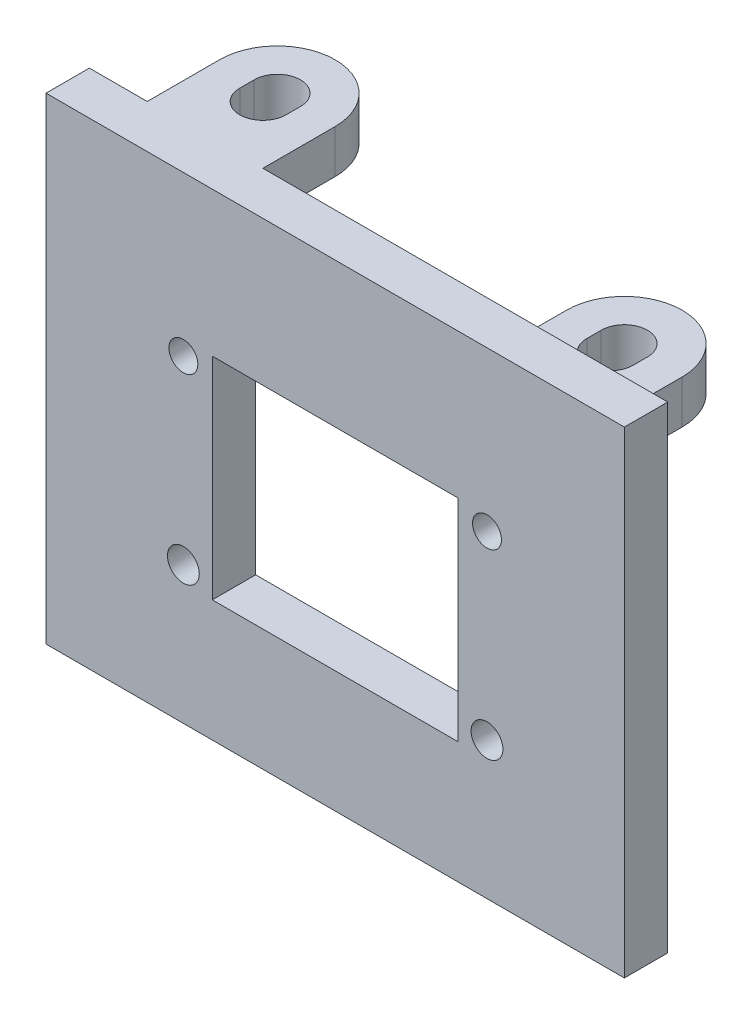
ISO-10303-21;
HEADER;
FILE_DESCRIPTION(('STEP AP214'),'2;1');
FILE_NAME('part.step','',(''),(''),'','','');
FILE_SCHEMA(('AUTOMOTIVE_DESIGN { 1 0 10303 214 1 1 1 1 }'));
ENDSEC;
DATA;
#1=APPLICATION_CONTEXT('core data for automotive mechanical design processes');
#2=APPLICATION_PROTOCOL_DEFINITION('international standard','automotive_design',2000,#1);
#3=PRODUCT_CONTEXT('',#1,'mechanical');
#4=PRODUCT('Part','Part','',(#3));
#5=PRODUCT_RELATED_PRODUCT_CATEGORY('part','',(#4));
#6=PRODUCT_DEFINITION_FORMATION('','',#4);
#7=PRODUCT_DEFINITION_CONTEXT('part definition',#1,'design');
#8=PRODUCT_DEFINITION('design','',#6,#7);
#9=PRODUCT_DEFINITION_SHAPE('','',#8);
#10=(LENGTH_UNIT() NAMED_UNIT(*) SI_UNIT(.MILLI.,.METRE.));
#11=(NAMED_UNIT(*) PLANE_ANGLE_UNIT() SI_UNIT($,.RADIAN.));
#12=(NAMED_UNIT(*) SI_UNIT($,.STERADIAN.) SOLID_ANGLE_UNIT());
#13=UNCERTAINTY_MEASURE_WITH_UNIT(LENGTH_MEASURE(1.E-05),#10,'distance_accuracy_value','');
#14=(GEOMETRIC_REPRESENTATION_CONTEXT(3) GLOBAL_UNCERTAINTY_ASSIGNED_CONTEXT((#13)) GLOBAL_UNIT_ASSIGNED_CONTEXT((#10,
#11,#12)) REPRESENTATION_CONTEXT('',''));
#15=CARTESIAN_POINT('',(0.,0.,0.));
#16=DIRECTION('',(0.,0.,1.));
#17=DIRECTION('',(1.,0.,0.));
#18=AXIS2_PLACEMENT_3D('',#15,#16,#17);
#19=CARTESIAN_POINT('',(0.,3.,3.));
#20=DIRECTION('',(0.,0.,1.));
#21=DIRECTION('',(1.,0.,0.));
#22=AXIS2_PLACEMENT_3D('',#19,#20,#21);
#23=PLANE('',#22);
#24=DIRECTION('',(-1.,0.,0.));
#25=VECTOR('',#24,1.);
#26=CARTESIAN_POINT('',(0.,3.,3.));
#27=LINE('',#26,#25);
#28=CARTESIAN_POINT('',(20.,3.,3.));
#29=VERTEX_POINT('',#28);
#30=CARTESIAN_POINT('',(-20.,3.,3.));
#31=VERTEX_POINT('',#30);
#32=EDGE_CURVE('E226',#29,#31,#27,.T.);
#33=ORIENTED_EDGE('',*,*,#32,.T.);
#34=DIRECTION('',(0.,-1.,0.));
#35=VECTOR('',#34,1.);
#36=CARTESIAN_POINT('',(-20.,0.,3.));
#37=LINE('',#36,#35);
#38=CARTESIAN_POINT('',(-20.,-30.,3.));
#39=VERTEX_POINT('',#38);
#40=EDGE_CURVE('E207',#31,#39,#37,.T.);
#41=ORIENTED_EDGE('',*,*,#40,.T.);
#42=DIRECTION('',(-1.,0.,0.));
#43=VECTOR('',#42,1.);
#44=CARTESIAN_POINT('',(0.,-30.,3.));
#45=LINE('',#44,#43);
#46=CARTESIAN_POINT('',(20.,-30.,2.99999999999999));
#47=VERTEX_POINT('',#46);
#48=EDGE_CURVE('E352',#47,#39,#45,.T.);
#49=ORIENTED_EDGE('',*,*,#48,.F.);
#50=DIRECTION('',(0.,-1.,0.));
#51=VECTOR('',#50,1.);
#52=CARTESIAN_POINT('',(20.,0.,3.));
#53=LINE('',#52,#51);
#54=EDGE_CURVE('E234',#29,#47,#53,.T.);
#55=ORIENTED_EDGE('',*,*,#54,.F.);
#56=EDGE_LOOP('',(#33,#41,#49,#55));
#57=FACE_BOUND('',#56,.T.);
#58=CARTESIAN_POINT('',(10.5,-8.,3.));
#59=DIRECTION('',(0.,0.,1.));
#60=DIRECTION('',(1.,0.,0.));
#61=AXIS2_PLACEMENT_3D('',#58,#59,#60);
#62=CIRCLE('',#61,1.);
#63=CARTESIAN_POINT('',(11.5,-8.,3.));
#64=VERTEX_POINT('',#63);
#65=EDGE_CURVE('E395',#64,#64,#62,.F.);
#66=ORIENTED_EDGE('',*,*,#65,.T.);
#67=EDGE_LOOP('',(#66));
#68=FACE_BOUND('',#67,.T.);
#69=CARTESIAN_POINT('',(-10.5,-20.5,3.));
#70=DIRECTION('',(0.,0.,1.));
#71=DIRECTION('',(1.,0.,0.));
#72=AXIS2_PLACEMENT_3D('',#69,#70,#71);
#73=CIRCLE('',#72,1.1);
#74=CARTESIAN_POINT('',(-9.4,-20.5,3.));
#75=VERTEX_POINT('',#74);
#76=EDGE_CURVE('E390',#75,#75,#73,.T.);
#77=ORIENTED_EDGE('',*,*,#76,.F.);
#78=EDGE_LOOP('',(#77));
#79=FACE_BOUND('',#78,.T.);
#80=CARTESIAN_POINT('',(-10.5,-8.,3.));
#81=DIRECTION('',(0.,0.,1.));
#82=DIRECTION('',(1.,0.,0.));
#83=AXIS2_PLACEMENT_3D('',#80,#81,#82);
#84=CIRCLE('',#83,1.);
#85=CARTESIAN_POINT('',(-9.5,-8.,3.));
#86=VERTEX_POINT('',#85);
#87=EDGE_CURVE('E394',#86,#86,#84,.T.);
#88=ORIENTED_EDGE('',*,*,#87,.F.);
#89=EDGE_LOOP('',(#88));
#90=FACE_BOUND('',#89,.T.);
#91=CARTESIAN_POINT('',(10.5,-20.5,3.));
#92=DIRECTION('',(0.,0.,1.));
#93=DIRECTION('',(1.,0.,0.));
#94=AXIS2_PLACEMENT_3D('',#91,#92,#93);
#95=CIRCLE('',#94,1.1);
#96=CARTESIAN_POINT('',(11.6,-20.5,3.));
#97=VERTEX_POINT('',#96);
#98=EDGE_CURVE('E381',#97,#97,#95,.F.);
#99=ORIENTED_EDGE('',*,*,#98,.T.);
#100=EDGE_LOOP('',(#99));
#101=FACE_BOUND('',#100,.T.);
#102=DIRECTION('',(1.,0.,0.));
#103=VECTOR('',#102,1.);
#104=CARTESIAN_POINT('',(0.,-21.6,3.));
#105=LINE('',#104,#103);
#106=CARTESIAN_POINT('',(-8.5,-21.6,3.));
#107=VERTEX_POINT('',#106);
#108=CARTESIAN_POINT('',(8.50000000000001,-21.6,3.));
#109=VERTEX_POINT('',#108);
#110=EDGE_CURVE('E62',#107,#109,#105,.T.);
#111=ORIENTED_EDGE('',*,*,#110,.F.);
#112=DIRECTION('',(0.,1.,0.));
#113=VECTOR('',#112,1.);
#114=CARTESIAN_POINT('',(-8.5,0.,3.));
#115=LINE('',#114,#113);
#116=CARTESIAN_POINT('',(-8.5,-7.,3.));
#117=VERTEX_POINT('',#116);
#118=EDGE_CURVE('E389',#107,#117,#115,.T.);
#119=ORIENTED_EDGE('',*,*,#118,.T.);
#120=DIRECTION('',(1.,0.,0.));
#121=VECTOR('',#120,1.);
#122=CARTESIAN_POINT('',(0.,-7.,3.));
#123=LINE('',#122,#121);
#124=CARTESIAN_POINT('',(8.5,-6.99999999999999,3.));
#125=VERTEX_POINT('',#124);
#126=EDGE_CURVE('E375',#117,#125,#123,.T.);
#127=ORIENTED_EDGE('',*,*,#126,.T.);
#128=DIRECTION('',(0.,1.,0.));
#129=VECTOR('',#128,1.);
#130=CARTESIAN_POINT('',(8.5,0.,3.));
#131=LINE('',#130,#129);
#132=EDGE_CURVE('E857',#109,#125,#131,.T.);
#133=ORIENTED_EDGE('',*,*,#132,.F.);
#134=EDGE_LOOP('',(#111,#119,#127,#133));
#135=FACE_BOUND('',#134,.T.);
#136=ADVANCED_FACE('F47',(#57,#68,#79,#90,#101,#135),#23,.T.);
#137=CARTESIAN_POINT('',(0.,3.,0.));
#138=DIRECTION('',(0.,0.,-1.));
#139=DIRECTION('',(-1.,0.,0.));
#140=AXIS2_PLACEMENT_3D('',#137,#138,#139);
#141=PLANE('',#140);
#142=DIRECTION('',(1.,0.,0.));
#143=VECTOR('',#142,1.);
#144=CARTESIAN_POINT('',(0.,-30.,0.));
#145=LINE('',#144,#143);
#146=CARTESIAN_POINT('',(-20.,-30.,0.));
#147=VERTEX_POINT('',#146);
#148=CARTESIAN_POINT('',(20.,-30.,0.));
#149=VERTEX_POINT('',#148);
#150=EDGE_CURVE('E412',#147,#149,#145,.T.);
#151=ORIENTED_EDGE('',*,*,#150,.F.);
#152=DIRECTION('',(0.,1.,0.));
#153=VECTOR('',#152,1.);
#154=CARTESIAN_POINT('',(-20.,3.,0.));
#155=LINE('',#154,#153);
#156=CARTESIAN_POINT('',(-20.,3.,0.));
#157=VERTEX_POINT('',#156);
#158=EDGE_CURVE('E340',#147,#157,#155,.T.);
#159=ORIENTED_EDGE('',*,*,#158,.T.);
#160=DIRECTION('',(1.,0.,0.));
#161=VECTOR('',#160,1.);
#162=CARTESIAN_POINT('',(0.,3.,0.));
#163=LINE('',#162,#161);
#164=CARTESIAN_POINT('',(-16.,3.,0.));
#165=VERTEX_POINT('',#164);
#166=EDGE_CURVE('E228',#157,#165,#163,.T.);
#167=ORIENTED_EDGE('',*,*,#166,.T.);
#168=DIRECTION('',(0.,-1.,0.));
#169=VECTOR('',#168,1.);
#170=CARTESIAN_POINT('',(-16.,3.,0.));
#171=LINE('',#170,#169);
#172=CARTESIAN_POINT('',(-16.,0.,0.));
#173=VERTEX_POINT('',#172);
#174=EDGE_CURVE('E273',#165,#173,#171,.T.);
#175=ORIENTED_EDGE('',*,*,#174,.T.);
#176=DIRECTION('',(1.,0.,0.));
#177=VECTOR('',#176,1.);
#178=CARTESIAN_POINT('',(0.,0.,0.));
#179=LINE('',#178,#177);
#180=CARTESIAN_POINT('',(-8.,0.,0.));
#181=VERTEX_POINT('',#180);
#182=EDGE_CURVE('E315',#173,#181,#179,.T.);
#183=ORIENTED_EDGE('',*,*,#182,.T.);
#184=DIRECTION('',(0.,-1.,0.));
#185=VECTOR('',#184,1.);
#186=CARTESIAN_POINT('',(-8.,3.,0.));
#187=LINE('',#186,#185);
#188=CARTESIAN_POINT('',(-8.,3.,0.));
#189=VERTEX_POINT('',#188);
#190=EDGE_CURVE('E305',#189,#181,#187,.T.);
#191=ORIENTED_EDGE('',*,*,#190,.F.);
#192=CARTESIAN_POINT('',(20.,3.,0.));
#193=VERTEX_POINT('',#192);
#194=EDGE_CURVE('E236',#189,#193,#163,.T.);
#195=ORIENTED_EDGE('',*,*,#194,.T.);
#196=DIRECTION('',(0.,1.,0.));
#197=VECTOR('',#196,1.);
#198=CARTESIAN_POINT('',(20.,3.,0.));
#199=LINE('',#198,#197);
#200=EDGE_CURVE('E230',#149,#193,#199,.T.);
#201=ORIENTED_EDGE('',*,*,#200,.F.);
#202=EDGE_LOOP('',(#151,#159,#167,#175,#183,#191,#195,#201));
#203=FACE_BOUND('',#202,.T.);
#204=CARTESIAN_POINT('',(10.5,-8.,0.));
#205=DIRECTION('',(0.,0.,-1.));
#206=DIRECTION('',(-1.,0.,0.));
#207=AXIS2_PLACEMENT_3D('',#204,#205,#206);
#208=CIRCLE('',#207,1.);
#209=CARTESIAN_POINT('',(9.5,-8.,0.));
#210=VERTEX_POINT('',#209);
#211=EDGE_CURVE('E335',#210,#210,#208,.F.);
#212=ORIENTED_EDGE('',*,*,#211,.T.);
#213=EDGE_LOOP('',(#212));
#214=FACE_BOUND('',#213,.T.);
#215=DIRECTION('',(1.,0.,0.));
#216=VECTOR('',#215,1.);
#217=CARTESIAN_POINT('',(0.,0.,0.));
#218=LINE('',#217,#216);
#219=CARTESIAN_POINT('',(8.,0.,0.));
#220=VERTEX_POINT('',#219);
#221=CARTESIAN_POINT('',(16.,0.,0.));
#222=VERTEX_POINT('',#221);
#223=EDGE_CURVE('E274',#220,#222,#218,.T.);
#224=ORIENTED_EDGE('',*,*,#223,.F.);
#225=DIRECTION('',(0.,1.,0.));
#226=VECTOR('',#225,1.);
#227=CARTESIAN_POINT('',(8.,-3.,0.));
#228=LINE('',#227,#226);
#229=CARTESIAN_POINT('',(8.,-3.,0.));
#230=VERTEX_POINT('',#229);
#231=EDGE_CURVE('E480',#230,#220,#228,.T.);
#232=ORIENTED_EDGE('',*,*,#231,.F.);
#233=DIRECTION('',(1.,0.,0.));
#234=VECTOR('',#233,1.);
#235=CARTESIAN_POINT('',(0.,-3.,0.));
#236=LINE('',#235,#234);
#237=CARTESIAN_POINT('',(16.,-3.,0.));
#238=VERTEX_POINT('',#237);
#239=EDGE_CURVE('E416',#230,#238,#236,.T.);
#240=ORIENTED_EDGE('',*,*,#239,.T.);
#241=DIRECTION('',(0.,1.,0.));
#242=VECTOR('',#241,1.);
#243=CARTESIAN_POINT('',(16.,-3.,0.));
#244=LINE('',#243,#242);
#245=EDGE_CURVE('E476',#238,#222,#244,.T.);
#246=ORIENTED_EDGE('',*,*,#245,.T.);
#247=EDGE_LOOP('',(#224,#232,#240,#246));
#248=FACE_BOUND('',#247,.T.);
#249=CARTESIAN_POINT('',(-10.5,-20.5,0.));
#250=DIRECTION('',(0.,0.,-1.));
#251=DIRECTION('',(-1.,0.,0.));
#252=AXIS2_PLACEMENT_3D('',#249,#250,#251);
#253=CIRCLE('',#252,1.1);
#254=CARTESIAN_POINT('',(-11.6,-20.5,0.));
#255=VERTEX_POINT('',#254);
#256=EDGE_CURVE('E339',#255,#255,#253,.T.);
#257=ORIENTED_EDGE('',*,*,#256,.F.);
#258=EDGE_LOOP('',(#257));
#259=FACE_BOUND('',#258,.T.);
#260=CARTESIAN_POINT('',(-10.5,-8.,0.));
#261=DIRECTION('',(0.,0.,-1.));
#262=DIRECTION('',(-1.,0.,0.));
#263=AXIS2_PLACEMENT_3D('',#260,#261,#262);
#264=CIRCLE('',#263,1.);
#265=CARTESIAN_POINT('',(-11.5,-8.,0.));
#266=VERTEX_POINT('',#265);
#267=EDGE_CURVE('E344',#266,#266,#264,.T.);
#268=ORIENTED_EDGE('',*,*,#267,.F.);
#269=EDGE_LOOP('',(#268));
#270=FACE_BOUND('',#269,.T.);
#271=CARTESIAN_POINT('',(10.5,-20.5,0.));
#272=DIRECTION('',(0.,0.,-1.));
#273=DIRECTION('',(-1.,0.,0.));
#274=AXIS2_PLACEMENT_3D('',#271,#272,#273);
#275=CIRCLE('',#274,1.1);
#276=CARTESIAN_POINT('',(9.4,-20.5,0.));
#277=VERTEX_POINT('',#276);
#278=EDGE_CURVE('E348',#277,#277,#275,.F.);
#279=ORIENTED_EDGE('',*,*,#278,.T.);
#280=EDGE_LOOP('',(#279));
#281=FACE_BOUND('',#280,.T.);
#282=DIRECTION('',(-1.,0.,0.));
#283=VECTOR('',#282,1.);
#284=CARTESIAN_POINT('',(0.,-21.6,0.));
#285=LINE('',#284,#283);
#286=CARTESIAN_POINT('',(8.50000000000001,-21.6,0.));
#287=VERTEX_POINT('',#286);
#288=CARTESIAN_POINT('',(-8.5,-21.6,0.));
#289=VERTEX_POINT('',#288);
#290=EDGE_CURVE('E11',#287,#289,#285,.T.);
#291=ORIENTED_EDGE('',*,*,#290,.F.);
#292=DIRECTION('',(0.,-1.,0.));
#293=VECTOR('',#292,1.);
#294=CARTESIAN_POINT('',(8.5,3.,0.));
#295=LINE('',#294,#293);
#296=CARTESIAN_POINT('',(8.5,-6.99999999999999,0.));
#297=VERTEX_POINT('',#296);
#298=EDGE_CURVE('E334',#297,#287,#295,.T.);
#299=ORIENTED_EDGE('',*,*,#298,.F.);
#300=DIRECTION('',(-1.,0.,0.));
#301=VECTOR('',#300,1.);
#302=CARTESIAN_POINT('',(0.,-6.99999999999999,0.));
#303=LINE('',#302,#301);
#304=CARTESIAN_POINT('',(-8.5,-7.,0.));
#305=VERTEX_POINT('',#304);
#306=EDGE_CURVE('E355',#297,#305,#303,.T.);
#307=ORIENTED_EDGE('',*,*,#306,.T.);
#308=DIRECTION('',(0.,-1.,0.));
#309=VECTOR('',#308,1.);
#310=CARTESIAN_POINT('',(-8.5,3.,0.));
#311=LINE('',#310,#309);
#312=EDGE_CURVE('E55',#305,#289,#311,.T.);
#313=ORIENTED_EDGE('',*,*,#312,.T.);
#314=EDGE_LOOP('',(#291,#299,#307,#313));
#315=FACE_BOUND('',#314,.T.);
#316=ADVANCED_FACE('F362',(#203,#214,#248,#259,#270,#281,#315),#141,.T.);
#317=CARTESIAN_POINT('',(0.,3.,0.));
#318=DIRECTION('',(0.,1.,0.));
#319=DIRECTION('',(0.,0.,1.));
#320=AXIS2_PLACEMENT_3D('',#317,#318,#319);
#321=PLANE('',#320);
#322=DIRECTION('',(0.,0.,1.));
#323=VECTOR('',#322,1.);
#324=CARTESIAN_POINT('',(-10.4,3.,0.));
#325=LINE('',#324,#323);
#326=CARTESIAN_POINT('',(-10.4,3.,-4.99999999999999));
#327=VERTEX_POINT('',#326);
#328=CARTESIAN_POINT('',(-10.4,3.,-3.99999999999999));
#329=VERTEX_POINT('',#328);
#330=EDGE_CURVE('E259',#327,#329,#325,.T.);
#331=ORIENTED_EDGE('',*,*,#330,.T.);
#332=CARTESIAN_POINT('',(-12.,3.,-3.99999999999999));
#333=DIRECTION('',(0.,1.,0.));
#334=DIRECTION('',(0.,0.,1.));
#335=AXIS2_PLACEMENT_3D('',#332,#333,#334);
#336=CIRCLE('',#335,1.6);
#337=CARTESIAN_POINT('',(-13.6,3.,-3.99999999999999));
#338=VERTEX_POINT('',#337);
#339=EDGE_CURVE('E263',#329,#338,#336,.F.);
#340=ORIENTED_EDGE('',*,*,#339,.T.);
#341=DIRECTION('',(0.,0.,1.));
#342=VECTOR('',#341,1.);
#343=CARTESIAN_POINT('',(-13.6,3.,0.));
#344=LINE('',#343,#342);
#345=CARTESIAN_POINT('',(-13.6,3.,-4.99999999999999));
#346=VERTEX_POINT('',#345);
#347=EDGE_CURVE('E266',#346,#338,#344,.T.);
#348=ORIENTED_EDGE('',*,*,#347,.F.);
#349=CARTESIAN_POINT('',(-12.,3.,-4.99999999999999));
#350=DIRECTION('',(0.,1.,0.));
#351=DIRECTION('',(0.,0.,1.));
#352=AXIS2_PLACEMENT_3D('',#349,#350,#351);
#353=CIRCLE('',#352,1.6);
#354=EDGE_CURVE('E270',#346,#327,#353,.F.);
#355=ORIENTED_EDGE('',*,*,#354,.T.);
#356=EDGE_LOOP('',(#331,#340,#348,#355));
#357=FACE_BOUND('',#356,.T.);
#358=ORIENTED_EDGE('',*,*,#166,.F.);
#359=DIRECTION('',(0.,0.,1.));
#360=VECTOR('',#359,1.);
#361=CARTESIAN_POINT('',(-20.,3.,-8.99999999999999));
#362=LINE('',#361,#360);
#363=EDGE_CURVE('E210',#157,#31,#362,.T.);
#364=ORIENTED_EDGE('',*,*,#363,.T.);
#365=ORIENTED_EDGE('',*,*,#32,.F.);
#366=DIRECTION('',(0.,0.,1.));
#367=VECTOR('',#366,1.);
#368=CARTESIAN_POINT('',(20.,3.,-8.99999999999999));
#369=LINE('',#368,#367);
#370=EDGE_CURVE('E219',#193,#29,#369,.T.);
#371=ORIENTED_EDGE('',*,*,#370,.F.);
#372=ORIENTED_EDGE('',*,*,#194,.F.);
#373=DIRECTION('',(0.,0.,1.));
#374=VECTOR('',#373,1.);
#375=CARTESIAN_POINT('',(-8.,3.,0.));
#376=LINE('',#375,#374);
#377=CARTESIAN_POINT('',(-8.,3.,-4.99999999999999));
#378=VERTEX_POINT('',#377);
#379=EDGE_CURVE('E242',#378,#189,#376,.T.);
#380=ORIENTED_EDGE('',*,*,#379,.F.);
#381=CARTESIAN_POINT('',(-12.,3.,-4.99999999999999));
#382=DIRECTION('',(0.,1.,0.));
#383=DIRECTION('',(0.,0.,1.));
#384=AXIS2_PLACEMENT_3D('',#381,#382,#383);
#385=CIRCLE('',#384,4.);
#386=CARTESIAN_POINT('',(-16.,3.,-5.));
#387=VERTEX_POINT('',#386);
#388=EDGE_CURVE('E253',#378,#387,#385,.T.);
#389=ORIENTED_EDGE('',*,*,#388,.T.);
#390=DIRECTION('',(0.,0.,1.));
#391=VECTOR('',#390,1.);
#392=CARTESIAN_POINT('',(-16.,3.,0.));
#393=LINE('',#392,#391);
#394=EDGE_CURVE('E256',#387,#165,#393,.T.);
#395=ORIENTED_EDGE('',*,*,#394,.T.);
#396=EDGE_LOOP('',(#358,#364,#365,#371,#372,#380,#389,#395));
#397=FACE_BOUND('',#396,.T.);
#398=ADVANCED_FACE('F224',(#357,#397),#321,.T.);
#399=CARTESIAN_POINT('',(0.,-30.,0.));
#400=DIRECTION('',(0.,1.,0.));
#401=DIRECTION('',(0.,0.,1.));
#402=AXIS2_PLACEMENT_3D('',#399,#400,#401);
#403=PLANE('',#402);
#404=DIRECTION('',(0.,0.,1.));
#405=VECTOR('',#404,1.);
#406=CARTESIAN_POINT('',(-20.,-30.,0.));
#407=LINE('',#406,#405);
#408=EDGE_CURVE('E213',#147,#39,#407,.T.);
#409=ORIENTED_EDGE('',*,*,#408,.F.);
#410=ORIENTED_EDGE('',*,*,#150,.T.);
#411=DIRECTION('',(0.,0.,1.));
#412=VECTOR('',#411,1.);
#413=CARTESIAN_POINT('',(20.,-30.,0.));
#414=LINE('',#413,#412);
#415=EDGE_CURVE('E328',#149,#47,#414,.T.);
#416=ORIENTED_EDGE('',*,*,#415,.T.);
#417=ORIENTED_EDGE('',*,*,#48,.T.);
#418=EDGE_LOOP('',(#409,#410,#416,#417));
#419=FACE_BOUND('',#418,.T.);
#420=ADVANCED_FACE('F543',(#419),#403,.F.);
#421=CARTESIAN_POINT('',(0.,-3.,0.));
#422=DIRECTION('',(0.,1.,0.));
#423=DIRECTION('',(0.,0.,1.));
#424=AXIS2_PLACEMENT_3D('',#421,#422,#423);
#425=PLANE('',#424);
#426=CARTESIAN_POINT('',(12.,-3.,-3.99999999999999));
#427=DIRECTION('',(0.,1.,0.));
#428=DIRECTION('',(0.,0.,1.));
#429=AXIS2_PLACEMENT_3D('',#426,#427,#428);
#430=CIRCLE('',#429,1.6);
#431=CARTESIAN_POINT('',(10.4,-3.,-3.99999999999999));
#432=VERTEX_POINT('',#431);
#433=CARTESIAN_POINT('',(13.6,-3.,-3.99999999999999));
#434=VERTEX_POINT('',#433);
#435=EDGE_CURVE('E421',#432,#434,#430,.T.);
#436=ORIENTED_EDGE('',*,*,#435,.T.);
#437=DIRECTION('',(0.,0.,1.));
#438=VECTOR('',#437,1.);
#439=CARTESIAN_POINT('',(13.6,-3.,0.));
#440=LINE('',#439,#438);
#441=CARTESIAN_POINT('',(13.6,-3.,-4.99999999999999));
#442=VERTEX_POINT('',#441);
#443=EDGE_CURVE('E431',#442,#434,#440,.T.);
#444=ORIENTED_EDGE('',*,*,#443,.F.);
#445=CARTESIAN_POINT('',(12.,-3.,-4.99999999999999));
#446=DIRECTION('',(0.,1.,0.));
#447=DIRECTION('',(0.,0.,1.));
#448=AXIS2_PLACEMENT_3D('',#445,#446,#447);
#449=CIRCLE('',#448,1.6);
#450=CARTESIAN_POINT('',(10.4,-3.,-4.99999999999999));
#451=VERTEX_POINT('',#450);
#452=EDGE_CURVE('E428',#442,#451,#449,.T.);
#453=ORIENTED_EDGE('',*,*,#452,.T.);
#454=DIRECTION('',(0.,0.,1.));
#455=VECTOR('',#454,1.);
#456=CARTESIAN_POINT('',(10.4,-3.,0.));
#457=LINE('',#456,#455);
#458=EDGE_CURVE('E424',#451,#432,#457,.T.);
#459=ORIENTED_EDGE('',*,*,#458,.T.);
#460=EDGE_LOOP('',(#436,#444,#453,#459));
#461=FACE_BOUND('',#460,.T.);
#462=ORIENTED_EDGE('',*,*,#239,.F.);
#463=DIRECTION('',(0.,0.,1.));
#464=VECTOR('',#463,1.);
#465=CARTESIAN_POINT('',(8.,-3.,0.));
#466=LINE('',#465,#464);
#467=CARTESIAN_POINT('',(8.,-3.,-4.99999999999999));
#468=VERTEX_POINT('',#467);
#469=EDGE_CURVE('E439',#468,#230,#466,.T.);
#470=ORIENTED_EDGE('',*,*,#469,.F.);
#471=CARTESIAN_POINT('',(12.,-3.,-4.99999999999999));
#472=DIRECTION('',(0.,1.,0.));
#473=DIRECTION('',(0.,0.,1.));
#474=AXIS2_PLACEMENT_3D('',#471,#472,#473);
#475=CIRCLE('',#474,4.);
#476=CARTESIAN_POINT('',(16.,-3.,-5.));
#477=VERTEX_POINT('',#476);
#478=EDGE_CURVE('E435',#468,#477,#475,.F.);
#479=ORIENTED_EDGE('',*,*,#478,.T.);
#480=DIRECTION('',(0.,0.,1.));
#481=VECTOR('',#480,1.);
#482=CARTESIAN_POINT('',(16.,-3.,0.));
#483=LINE('',#482,#481);
#484=EDGE_CURVE('E443',#477,#238,#483,.T.);
#485=ORIENTED_EDGE('',*,*,#484,.T.);
#486=EDGE_LOOP('',(#462,#470,#479,#485));
#487=FACE_BOUND('',#486,.T.);
#488=ADVANCED_FACE('F517',(#461,#487),#425,.F.);
#489=CARTESIAN_POINT('',(0.,0.,0.));
#490=DIRECTION('',(0.,1.,0.));
#491=DIRECTION('',(0.,0.,1.));
#492=AXIS2_PLACEMENT_3D('',#489,#490,#491);
#493=PLANE('',#492);
#494=DIRECTION('',(0.,0.,1.));
#495=VECTOR('',#494,1.);
#496=CARTESIAN_POINT('',(-10.4,0.,0.));
#497=LINE('',#496,#495);
#498=CARTESIAN_POINT('',(-10.4,0.,-4.99999999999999));
#499=VERTEX_POINT('',#498);
#500=CARTESIAN_POINT('',(-10.4,0.,-3.99999999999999));
#501=VERTEX_POINT('',#500);
#502=EDGE_CURVE('E289',#499,#501,#497,.T.);
#503=ORIENTED_EDGE('',*,*,#502,.F.);
#504=CARTESIAN_POINT('',(-12.,0.,-4.99999999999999));
#505=DIRECTION('',(0.,1.,0.));
#506=DIRECTION('',(0.,0.,1.));
#507=AXIS2_PLACEMENT_3D('',#504,#505,#506);
#508=CIRCLE('',#507,1.6);
#509=CARTESIAN_POINT('',(-13.6,0.,-4.99999999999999));
#510=VERTEX_POINT('',#509);
#511=EDGE_CURVE('E237',#510,#499,#508,.F.);
#512=ORIENTED_EDGE('',*,*,#511,.F.);
#513=DIRECTION('',(0.,0.,1.));
#514=VECTOR('',#513,1.);
#515=CARTESIAN_POINT('',(-13.6,0.,0.));
#516=LINE('',#515,#514);
#517=CARTESIAN_POINT('',(-13.6,0.,-3.99999999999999));
#518=VERTEX_POINT('',#517);
#519=EDGE_CURVE('E244',#510,#518,#516,.T.);
#520=ORIENTED_EDGE('',*,*,#519,.T.);
#521=CARTESIAN_POINT('',(-12.,0.,-3.99999999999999));
#522=DIRECTION('',(0.,1.,0.));
#523=DIRECTION('',(0.,0.,1.));
#524=AXIS2_PLACEMENT_3D('',#521,#522,#523);
#525=CIRCLE('',#524,1.6);
#526=EDGE_CURVE('E293',#501,#518,#525,.F.);
#527=ORIENTED_EDGE('',*,*,#526,.F.);
#528=EDGE_LOOP('',(#503,#512,#520,#527));
#529=FACE_BOUND('',#528,.T.);
#530=ORIENTED_EDGE('',*,*,#182,.F.);
#531=DIRECTION('',(0.,0.,1.));
#532=VECTOR('',#531,1.);
#533=CARTESIAN_POINT('',(-16.,0.,0.));
#534=LINE('',#533,#532);
#535=CARTESIAN_POINT('',(-16.,0.,-5.));
#536=VERTEX_POINT('',#535);
#537=EDGE_CURVE('E285',#536,#173,#534,.T.);
#538=ORIENTED_EDGE('',*,*,#537,.F.);
#539=CARTESIAN_POINT('',(-12.,0.,-4.99999999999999));
#540=DIRECTION('',(0.,1.,0.));
#541=DIRECTION('',(0.,0.,1.));
#542=AXIS2_PLACEMENT_3D('',#539,#540,#541);
#543=CIRCLE('',#542,4.);
#544=CARTESIAN_POINT('',(-8.,0.,-4.99999999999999));
#545=VERTEX_POINT('',#544);
#546=EDGE_CURVE('E282',#545,#536,#543,.T.);
#547=ORIENTED_EDGE('',*,*,#546,.F.);
#548=DIRECTION('',(0.,0.,1.));
#549=VECTOR('',#548,1.);
#550=CARTESIAN_POINT('',(-8.,0.,0.));
#551=LINE('',#550,#549);
#552=EDGE_CURVE('E277',#545,#181,#551,.T.);
#553=ORIENTED_EDGE('',*,*,#552,.T.);
#554=EDGE_LOOP('',(#530,#538,#547,#553));
#555=FACE_BOUND('',#554,.T.);
#556=ADVANCED_FACE('F575',(#529,#555),#493,.F.);
#557=CARTESIAN_POINT('',(-10.4,3.,0.));
#558=DIRECTION('',(1.,0.,0.));
#559=DIRECTION('',(0.,0.,-1.));
#560=AXIS2_PLACEMENT_3D('',#557,#558,#559);
#561=PLANE('',#560);
#562=ORIENTED_EDGE('',*,*,#502,.T.);
#563=DIRECTION('',(0.,-1.,0.));
#564=VECTOR('',#563,1.);
#565=CARTESIAN_POINT('',(-10.4,3.,-3.99999999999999));
#566=LINE('',#565,#564);
#567=EDGE_CURVE('E311',#329,#501,#566,.T.);
#568=ORIENTED_EDGE('',*,*,#567,.F.);
#569=ORIENTED_EDGE('',*,*,#330,.F.);
#570=DIRECTION('',(0.,-1.,0.));
#571=VECTOR('',#570,1.);
#572=CARTESIAN_POINT('',(-10.4,3.,-4.99999999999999));
#573=LINE('',#572,#571);
#574=EDGE_CURVE('E300',#327,#499,#573,.T.);
#575=ORIENTED_EDGE('',*,*,#574,.T.);
#576=EDGE_LOOP('',(#562,#568,#569,#575));
#577=FACE_BOUND('',#576,.T.);
#578=ADVANCED_FACE('F550',(#577),#561,.F.);
#579=CARTESIAN_POINT('',(-12.,3.,-3.99999999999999));
#580=DIRECTION('',(0.,-1.,0.));
#581=DIRECTION('',(0.,0.,-1.));
#582=AXIS2_PLACEMENT_3D('',#579,#580,#581);
#583=CYLINDRICAL_SURFACE('',#582,1.6);
#584=ORIENTED_EDGE('',*,*,#526,.T.);
#585=DIRECTION('',(0.,-1.,0.));
#586=VECTOR('',#585,1.);
#587=CARTESIAN_POINT('',(-13.6,3.,-3.99999999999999));
#588=LINE('',#587,#586);
#589=EDGE_CURVE('E308',#338,#518,#588,.T.);
#590=ORIENTED_EDGE('',*,*,#589,.F.);
#591=ORIENTED_EDGE('',*,*,#339,.F.);
#592=ORIENTED_EDGE('',*,*,#567,.T.);
#593=EDGE_LOOP('',(#584,#590,#591,#592));
#594=FACE_BOUND('',#593,.T.);
#595=ADVANCED_FACE('F568',(#594),#583,.F.);
#596=CARTESIAN_POINT('',(-13.6,3.,0.));
#597=DIRECTION('',(1.,0.,0.));
#598=DIRECTION('',(0.,0.,-1.));
#599=AXIS2_PLACEMENT_3D('',#596,#597,#598);
#600=PLANE('',#599);
#601=ORIENTED_EDGE('',*,*,#519,.F.);
#602=DIRECTION('',(0.,-1.,0.));
#603=VECTOR('',#602,1.);
#604=CARTESIAN_POINT('',(-13.6,3.,-4.99999999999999));
#605=LINE('',#604,#603);
#606=EDGE_CURVE('E304',#346,#510,#605,.T.);
#607=ORIENTED_EDGE('',*,*,#606,.F.);
#608=ORIENTED_EDGE('',*,*,#347,.T.);
#609=ORIENTED_EDGE('',*,*,#589,.T.);
#610=EDGE_LOOP('',(#601,#607,#608,#609));
#611=FACE_BOUND('',#610,.T.);
#612=ADVANCED_FACE('F562',(#611),#600,.T.);
#613=CARTESIAN_POINT('',(-8.,3.,0.));
#614=DIRECTION('',(1.,0.,0.));
#615=DIRECTION('',(0.,0.,-1.));
#616=AXIS2_PLACEMENT_3D('',#613,#614,#615);
#617=PLANE('',#616);
#618=ORIENTED_EDGE('',*,*,#552,.F.);
#619=DIRECTION('',(0.,-1.,0.));
#620=VECTOR('',#619,1.);
#621=CARTESIAN_POINT('',(-8.,3.,-4.99999999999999));
#622=LINE('',#621,#620);
#623=EDGE_CURVE('E323',#378,#545,#622,.T.);
#624=ORIENTED_EDGE('',*,*,#623,.F.);
#625=ORIENTED_EDGE('',*,*,#379,.T.);
#626=ORIENTED_EDGE('',*,*,#190,.T.);
#627=EDGE_LOOP('',(#618,#624,#625,#626));
#628=FACE_BOUND('',#627,.T.);
#629=ADVANCED_FACE('F559',(#628),#617,.T.);
#630=CARTESIAN_POINT('',(-12.,3.,-4.99999999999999));
#631=DIRECTION('',(0.,-1.,0.));
#632=DIRECTION('',(0.,0.,-1.));
#633=AXIS2_PLACEMENT_3D('',#630,#631,#632);
#634=CYLINDRICAL_SURFACE('',#633,4.);
#635=ORIENTED_EDGE('',*,*,#546,.T.);
#636=DIRECTION('',(0.,-1.,0.));
#637=VECTOR('',#636,1.);
#638=CARTESIAN_POINT('',(-16.,3.,-5.));
#639=LINE('',#638,#637);
#640=EDGE_CURVE('E319',#387,#536,#639,.T.);
#641=ORIENTED_EDGE('',*,*,#640,.F.);
#642=ORIENTED_EDGE('',*,*,#388,.F.);
#643=ORIENTED_EDGE('',*,*,#623,.T.);
#644=EDGE_LOOP('',(#635,#641,#642,#643));
#645=FACE_BOUND('',#644,.T.);
#646=ADVANCED_FACE('F556',(#645),#634,.T.);
#647=CARTESIAN_POINT('',(-16.,3.,0.));
#648=DIRECTION('',(1.,0.,0.));
#649=DIRECTION('',(0.,0.,-1.));
#650=AXIS2_PLACEMENT_3D('',#647,#648,#649);
#651=PLANE('',#650);
#652=ORIENTED_EDGE('',*,*,#537,.T.);
#653=ORIENTED_EDGE('',*,*,#174,.F.);
#654=ORIENTED_EDGE('',*,*,#394,.F.);
#655=ORIENTED_EDGE('',*,*,#640,.T.);
#656=EDGE_LOOP('',(#652,#653,#654,#655));
#657=FACE_BOUND('',#656,.T.);
#658=ADVANCED_FACE('F552',(#657),#651,.F.);
#659=CARTESIAN_POINT('',(-12.,3.,-4.99999999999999));
#660=DIRECTION('',(0.,-1.,0.));
#661=DIRECTION('',(0.,0.,-1.));
#662=AXIS2_PLACEMENT_3D('',#659,#660,#661);
#663=CYLINDRICAL_SURFACE('',#662,1.6);
#664=ORIENTED_EDGE('',*,*,#511,.T.);
#665=ORIENTED_EDGE('',*,*,#574,.F.);
#666=ORIENTED_EDGE('',*,*,#354,.F.);
#667=ORIENTED_EDGE('',*,*,#606,.T.);
#668=EDGE_LOOP('',(#664,#665,#666,#667));
#669=FACE_BOUND('',#668,.T.);
#670=ADVANCED_FACE('F555',(#669),#663,.F.);
#671=CARTESIAN_POINT('',(12.,-3.,-4.99999999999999));
#672=DIRECTION('',(0.,1.,0.));
#673=DIRECTION('',(0.,0.,1.));
#674=AXIS2_PLACEMENT_3D('',#671,#672,#673);
#675=CYLINDRICAL_SURFACE('',#674,4.);
#676=CARTESIAN_POINT('',(12.,0.,-4.99999999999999));
#677=DIRECTION('',(0.,1.,0.));
#678=DIRECTION('',(0.,0.,1.));
#679=AXIS2_PLACEMENT_3D('',#676,#677,#678);
#680=CIRCLE('',#679,4.);
#681=CARTESIAN_POINT('',(8.,0.,-4.99999999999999));
#682=VERTEX_POINT('',#681);
#683=CARTESIAN_POINT('',(16.,0.,-5.));
#684=VERTEX_POINT('',#683);
#685=EDGE_CURVE('E459',#682,#684,#680,.F.);
#686=ORIENTED_EDGE('',*,*,#685,.T.);
#687=DIRECTION('',(0.,1.,0.));
#688=VECTOR('',#687,1.);
#689=CARTESIAN_POINT('',(16.,-3.,-5.));
#690=LINE('',#689,#688);
#691=EDGE_CURVE('E278',#477,#684,#690,.T.);
#692=ORIENTED_EDGE('',*,*,#691,.F.);
#693=ORIENTED_EDGE('',*,*,#478,.F.);
#694=DIRECTION('',(0.,1.,0.));
#695=VECTOR('',#694,1.);
#696=CARTESIAN_POINT('',(8.,-3.,-4.99999999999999));
#697=LINE('',#696,#695);
#698=EDGE_CURVE('E484',#468,#682,#697,.T.);
#699=ORIENTED_EDGE('',*,*,#698,.T.);
#700=EDGE_LOOP('',(#686,#692,#693,#699));
#701=FACE_BOUND('',#700,.T.);
#702=ADVANCED_FACE('F609',(#701),#675,.T.);
#703=CARTESIAN_POINT('',(16.,-3.,0.));
#704=DIRECTION('',(-1.,0.,0.));
#705=DIRECTION('',(0.,0.,1.));
#706=AXIS2_PLACEMENT_3D('',#703,#704,#705);
#707=PLANE('',#706);
#708=DIRECTION('',(0.,0.,1.));
#709=VECTOR('',#708,1.);
#710=CARTESIAN_POINT('',(16.,0.,0.));
#711=LINE('',#710,#709);
#712=EDGE_CURVE('E425',#684,#222,#711,.T.);
#713=ORIENTED_EDGE('',*,*,#712,.T.);
#714=ORIENTED_EDGE('',*,*,#245,.F.);
#715=ORIENTED_EDGE('',*,*,#484,.F.);
#716=ORIENTED_EDGE('',*,*,#691,.T.);
#717=EDGE_LOOP('',(#713,#714,#715,#716));
#718=FACE_BOUND('',#717,.T.);
#719=ADVANCED_FACE('F607',(#718),#707,.F.);
#720=CARTESIAN_POINT('',(12.,-3.,-3.99999999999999));
#721=DIRECTION('',(0.,1.,0.));
#722=DIRECTION('',(0.,0.,1.));
#723=AXIS2_PLACEMENT_3D('',#720,#721,#722);
#724=CYLINDRICAL_SURFACE('',#723,1.6);
#725=CARTESIAN_POINT('',(12.,0.,-3.99999999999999));
#726=DIRECTION('',(0.,1.,0.));
#727=DIRECTION('',(0.,0.,1.));
#728=AXIS2_PLACEMENT_3D('',#725,#726,#727);
#729=CIRCLE('',#728,1.6);
#730=CARTESIAN_POINT('',(10.4,0.,-3.99999999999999));
#731=VERTEX_POINT('',#730);
#732=CARTESIAN_POINT('',(13.6,0.,-3.99999999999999));
#733=VERTEX_POINT('',#732);
#734=EDGE_CURVE('E420',#731,#733,#729,.T.);
#735=ORIENTED_EDGE('',*,*,#734,.T.);
#736=DIRECTION('',(0.,1.,0.));
#737=VECTOR('',#736,1.);
#738=CARTESIAN_POINT('',(13.6,-3.,-3.99999999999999));
#739=LINE('',#738,#737);
#740=EDGE_CURVE('E487',#434,#733,#739,.T.);
#741=ORIENTED_EDGE('',*,*,#740,.F.);
#742=ORIENTED_EDGE('',*,*,#435,.F.);
#743=DIRECTION('',(0.,1.,0.));
#744=VECTOR('',#743,1.);
#745=CARTESIAN_POINT('',(10.4,-3.,-3.99999999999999));
#746=LINE('',#745,#744);
#747=EDGE_CURVE('E247',#432,#731,#746,.T.);
#748=ORIENTED_EDGE('',*,*,#747,.T.);
#749=EDGE_LOOP('',(#735,#741,#742,#748));
#750=FACE_BOUND('',#749,.T.);
#751=ADVANCED_FACE('F505',(#750),#724,.F.);
#752=CARTESIAN_POINT('',(13.6,-3.,0.));
#753=DIRECTION('',(-1.,0.,0.));
#754=DIRECTION('',(0.,0.,1.));
#755=AXIS2_PLACEMENT_3D('',#752,#753,#754);
#756=PLANE('',#755);
#757=DIRECTION('',(0.,0.,1.));
#758=VECTOR('',#757,1.);
#759=CARTESIAN_POINT('',(13.6,0.,0.));
#760=LINE('',#759,#758);
#761=CARTESIAN_POINT('',(13.6,0.,-4.99999999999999));
#762=VERTEX_POINT('',#761);
#763=EDGE_CURVE('E455',#762,#733,#760,.T.);
#764=ORIENTED_EDGE('',*,*,#763,.F.);
#765=DIRECTION('',(0.,1.,0.));
#766=VECTOR('',#765,1.);
#767=CARTESIAN_POINT('',(13.6,-3.,-4.99999999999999));
#768=LINE('',#767,#766);
#769=EDGE_CURVE('E490',#442,#762,#768,.T.);
#770=ORIENTED_EDGE('',*,*,#769,.F.);
#771=ORIENTED_EDGE('',*,*,#443,.T.);
#772=ORIENTED_EDGE('',*,*,#740,.T.);
#773=EDGE_LOOP('',(#764,#770,#771,#772));
#774=FACE_BOUND('',#773,.T.);
#775=ADVANCED_FACE('F513',(#774),#756,.T.);
#776=CARTESIAN_POINT('',(12.,-3.,-4.99999999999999));
#777=DIRECTION('',(0.,1.,0.));
#778=DIRECTION('',(0.,0.,1.));
#779=AXIS2_PLACEMENT_3D('',#776,#777,#778);
#780=CYLINDRICAL_SURFACE('',#779,1.6);
#781=CARTESIAN_POINT('',(12.,0.,-4.99999999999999));
#782=DIRECTION('',(0.,1.,0.));
#783=DIRECTION('',(0.,0.,1.));
#784=AXIS2_PLACEMENT_3D('',#781,#782,#783);
#785=CIRCLE('',#784,1.6);
#786=CARTESIAN_POINT('',(10.4,0.,-4.99999999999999));
#787=VERTEX_POINT('',#786);
#788=EDGE_CURVE('E452',#762,#787,#785,.T.);
#789=ORIENTED_EDGE('',*,*,#788,.T.);
#790=DIRECTION('',(0.,1.,0.));
#791=VECTOR('',#790,1.);
#792=CARTESIAN_POINT('',(10.4,-3.,-4.99999999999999));
#793=LINE('',#792,#791);
#794=EDGE_CURVE('E492',#451,#787,#793,.T.);
#795=ORIENTED_EDGE('',*,*,#794,.F.);
#796=ORIENTED_EDGE('',*,*,#452,.F.);
#797=ORIENTED_EDGE('',*,*,#769,.T.);
#798=EDGE_LOOP('',(#789,#795,#796,#797));
#799=FACE_BOUND('',#798,.T.);
#800=ADVANCED_FACE('F522',(#799),#780,.F.);
#801=CARTESIAN_POINT('',(10.4,-3.,0.));
#802=DIRECTION('',(-1.,0.,0.));
#803=DIRECTION('',(0.,0.,1.));
#804=AXIS2_PLACEMENT_3D('',#801,#802,#803);
#805=PLANE('',#804);
#806=DIRECTION('',(0.,0.,1.));
#807=VECTOR('',#806,1.);
#808=CARTESIAN_POINT('',(10.4,0.,0.));
#809=LINE('',#808,#807);
#810=EDGE_CURVE('E449',#787,#731,#809,.T.);
#811=ORIENTED_EDGE('',*,*,#810,.T.);
#812=ORIENTED_EDGE('',*,*,#747,.F.);
#813=ORIENTED_EDGE('',*,*,#458,.F.);
#814=ORIENTED_EDGE('',*,*,#794,.T.);
#815=EDGE_LOOP('',(#811,#812,#813,#814));
#816=FACE_BOUND('',#815,.T.);
#817=ADVANCED_FACE('F519',(#816),#805,.F.);
#818=CARTESIAN_POINT('',(8.,-3.,0.));
#819=DIRECTION('',(-1.,0.,0.));
#820=DIRECTION('',(0.,0.,1.));
#821=AXIS2_PLACEMENT_3D('',#818,#819,#820);
#822=PLANE('',#821);
#823=DIRECTION('',(0.,0.,1.));
#824=VECTOR('',#823,1.);
#825=CARTESIAN_POINT('',(8.,0.,0.));
#826=LINE('',#825,#824);
#827=EDGE_CURVE('E463',#682,#220,#826,.T.);
#828=ORIENTED_EDGE('',*,*,#827,.F.);
#829=ORIENTED_EDGE('',*,*,#698,.F.);
#830=ORIENTED_EDGE('',*,*,#469,.T.);
#831=ORIENTED_EDGE('',*,*,#231,.T.);
#832=EDGE_LOOP('',(#828,#829,#830,#831));
#833=FACE_BOUND('',#832,.T.);
#834=ADVANCED_FACE('F521',(#833),#822,.T.);
#835=CARTESIAN_POINT('',(0.,0.,0.));
#836=DIRECTION('',(0.,1.,0.));
#837=DIRECTION('',(0.,0.,1.));
#838=AXIS2_PLACEMENT_3D('',#835,#836,#837);
#839=PLANE('',#838);
#840=ORIENTED_EDGE('',*,*,#734,.F.);
#841=ORIENTED_EDGE('',*,*,#810,.F.);
#842=ORIENTED_EDGE('',*,*,#788,.F.);
#843=ORIENTED_EDGE('',*,*,#763,.T.);
#844=EDGE_LOOP('',(#840,#841,#842,#843));
#845=FACE_BOUND('',#844,.T.);
#846=ORIENTED_EDGE('',*,*,#827,.T.);
#847=ORIENTED_EDGE('',*,*,#223,.T.);
#848=ORIENTED_EDGE('',*,*,#712,.F.);
#849=ORIENTED_EDGE('',*,*,#685,.F.);
#850=EDGE_LOOP('',(#846,#847,#848,#849));
#851=FACE_BOUND('',#850,.T.);
#852=ADVANCED_FACE('F508',(#845,#851),#839,.T.);
#853=CARTESIAN_POINT('',(20.,0.,-8.99999999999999));
#854=DIRECTION('',(-1.,0.,0.));
#855=DIRECTION('',(0.,-1.,0.));
#856=AXIS2_PLACEMENT_3D('',#853,#854,#855);
#857=PLANE('',#856);
#858=ORIENTED_EDGE('',*,*,#200,.T.);
#859=ORIENTED_EDGE('',*,*,#370,.T.);
#860=ORIENTED_EDGE('',*,*,#54,.T.);
#861=ORIENTED_EDGE('',*,*,#415,.F.);
#862=EDGE_LOOP('',(#858,#859,#860,#861));
#863=FACE_BOUND('',#862,.T.);
#864=ADVANCED_FACE('F585',(#863),#857,.F.);
#865=CARTESIAN_POINT('',(-20.,0.,-8.99999999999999));
#866=DIRECTION('',(-1.,0.,0.));
#867=DIRECTION('',(0.,-1.,0.));
#868=AXIS2_PLACEMENT_3D('',#865,#866,#867);
#869=PLANE('',#868);
#870=ORIENTED_EDGE('',*,*,#408,.T.);
#871=ORIENTED_EDGE('',*,*,#40,.F.);
#872=ORIENTED_EDGE('',*,*,#363,.F.);
#873=ORIENTED_EDGE('',*,*,#158,.F.);
#874=EDGE_LOOP('',(#870,#871,#872,#873));
#875=FACE_BOUND('',#874,.T.);
#876=ADVANCED_FACE('F209',(#875),#869,.T.);
#877=CARTESIAN_POINT('',(10.5,-8.,-8.99999999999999));
#878=DIRECTION('',(0.,0.,1.));
#879=DIRECTION('',(1.,0.,0.));
#880=AXIS2_PLACEMENT_3D('',#877,#878,#879);
#881=CYLINDRICAL_SURFACE('',#880,1.);
#882=ORIENTED_EDGE('',*,*,#211,.F.);
#883=EDGE_LOOP('',(#882));
#884=FACE_BOUND('',#883,.T.);
#885=ORIENTED_EDGE('',*,*,#65,.F.);
#886=EDGE_LOOP('',(#885));
#887=FACE_BOUND('',#886,.T.);
#888=ADVANCED_FACE('F592',(#884,#887),#881,.F.);
#889=CARTESIAN_POINT('',(-10.5,-20.5,-8.99999999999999));
#890=DIRECTION('',(0.,0.,1.));
#891=DIRECTION('',(1.,0.,0.));
#892=AXIS2_PLACEMENT_3D('',#889,#890,#891);
#893=CYLINDRICAL_SURFACE('',#892,1.1);
#894=ORIENTED_EDGE('',*,*,#256,.T.);
#895=EDGE_LOOP('',(#894));
#896=FACE_BOUND('',#895,.T.);
#897=ORIENTED_EDGE('',*,*,#76,.T.);
#898=EDGE_LOOP('',(#897));
#899=FACE_BOUND('',#898,.T.);
#900=ADVANCED_FACE('F602',(#896,#899),#893,.F.);
#901=CARTESIAN_POINT('',(-10.5,-8.,-8.99999999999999));
#902=DIRECTION('',(0.,0.,1.));
#903=DIRECTION('',(1.,0.,0.));
#904=AXIS2_PLACEMENT_3D('',#901,#902,#903);
#905=CYLINDRICAL_SURFACE('',#904,1.);
#906=ORIENTED_EDGE('',*,*,#267,.T.);
#907=EDGE_LOOP('',(#906));
#908=FACE_BOUND('',#907,.T.);
#909=ORIENTED_EDGE('',*,*,#87,.T.);
#910=EDGE_LOOP('',(#909));
#911=FACE_BOUND('',#910,.T.);
#912=ADVANCED_FACE('F598',(#908,#911),#905,.F.);
#913=CARTESIAN_POINT('',(10.5,-20.5,-8.99999999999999));
#914=DIRECTION('',(0.,0.,1.));
#915=DIRECTION('',(1.,0.,0.));
#916=AXIS2_PLACEMENT_3D('',#913,#914,#915);
#917=CYLINDRICAL_SURFACE('',#916,1.1);
#918=ORIENTED_EDGE('',*,*,#278,.F.);
#919=EDGE_LOOP('',(#918));
#920=FACE_BOUND('',#919,.T.);
#921=ORIENTED_EDGE('',*,*,#98,.F.);
#922=EDGE_LOOP('',(#921));
#923=FACE_BOUND('',#922,.T.);
#924=ADVANCED_FACE('F601',(#920,#923),#917,.F.);
#925=CARTESIAN_POINT('',(0.,-21.6,-8.99999999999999));
#926=DIRECTION('',(0.,-1.,0.));
#927=DIRECTION('',(1.,0.,0.));
#928=AXIS2_PLACEMENT_3D('',#925,#926,#927);
#929=PLANE('',#928);
#930=ORIENTED_EDGE('',*,*,#290,.T.);
#931=DIRECTION('',(0.,0.,1.));
#932=VECTOR('',#931,1.);
#933=CARTESIAN_POINT('',(-8.5,-21.6,-8.99999999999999));
#934=LINE('',#933,#932);
#935=EDGE_CURVE('E371',#289,#107,#934,.T.);
#936=ORIENTED_EDGE('',*,*,#935,.T.);
#937=ORIENTED_EDGE('',*,*,#110,.T.);
#938=DIRECTION('',(0.,0.,1.));
#939=VECTOR('',#938,1.);
#940=CARTESIAN_POINT('',(8.50000000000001,-21.6,-8.99999999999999));
#941=LINE('',#940,#939);
#942=EDGE_CURVE('E383',#287,#109,#941,.T.);
#943=ORIENTED_EDGE('',*,*,#942,.F.);
#944=EDGE_LOOP('',(#930,#936,#937,#943));
#945=FACE_BOUND('',#944,.T.);
#946=ADVANCED_FACE('F817',(#945),#929,.F.);
#947=CARTESIAN_POINT('',(-8.5,0.,-8.99999999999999));
#948=DIRECTION('',(1.,0.,0.));
#949=DIRECTION('',(0.,0.,-1.));
#950=AXIS2_PLACEMENT_3D('',#947,#948,#949);
#951=PLANE('',#950);
#952=DIRECTION('',(0.,0.,1.));
#953=VECTOR('',#952,1.);
#954=CARTESIAN_POINT('',(-8.5,-7.,-8.99999999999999));
#955=LINE('',#954,#953);
#956=EDGE_CURVE('E369',#305,#117,#955,.T.);
#957=ORIENTED_EDGE('',*,*,#956,.T.);
#958=ORIENTED_EDGE('',*,*,#118,.F.);
#959=ORIENTED_EDGE('',*,*,#935,.F.);
#960=ORIENTED_EDGE('',*,*,#312,.F.);
#961=EDGE_LOOP('',(#957,#958,#959,#960));
#962=FACE_BOUND('',#961,.T.);
#963=ADVANCED_FACE('F367',(#962),#951,.T.);
#964=CARTESIAN_POINT('',(0.,-7.,-8.99999999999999));
#965=DIRECTION('',(0.,-1.,0.));
#966=DIRECTION('',(1.,0.,0.));
#967=AXIS2_PLACEMENT_3D('',#964,#965,#966);
#968=PLANE('',#967);
#969=DIRECTION('',(0.,0.,1.));
#970=VECTOR('',#969,1.);
#971=CARTESIAN_POINT('',(8.5,-6.99999999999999,-8.99999999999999));
#972=LINE('',#971,#970);
#973=EDGE_CURVE('E70',#297,#125,#972,.T.);
#974=ORIENTED_EDGE('',*,*,#973,.T.);
#975=ORIENTED_EDGE('',*,*,#126,.F.);
#976=ORIENTED_EDGE('',*,*,#956,.F.);
#977=ORIENTED_EDGE('',*,*,#306,.F.);
#978=EDGE_LOOP('',(#974,#975,#976,#977));
#979=FACE_BOUND('',#978,.T.);
#980=ADVANCED_FACE('F373',(#979),#968,.T.);
#981=CARTESIAN_POINT('',(8.5,0.,-8.99999999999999));
#982=DIRECTION('',(1.,0.,0.));
#983=DIRECTION('',(0.,1.,0.));
#984=AXIS2_PLACEMENT_3D('',#981,#982,#983);
#985=PLANE('',#984);
#986=ORIENTED_EDGE('',*,*,#298,.T.);
#987=ORIENTED_EDGE('',*,*,#942,.T.);
#988=ORIENTED_EDGE('',*,*,#132,.T.);
#989=ORIENTED_EDGE('',*,*,#973,.F.);
#990=EDGE_LOOP('',(#986,#987,#988,#989));
#991=FACE_BOUND('',#990,.T.);
#992=ADVANCED_FACE('F843',(#991),#985,.F.);
#993=CLOSED_SHELL('',(#136,#316,#398,#420,#488,#556,#578,#595,#612,#629,#646,#658,#670,#702,
#719,#751,#775,#800,#817,#834,#852,#864,#876,#888,#900,#912,#924,#946,#963,#980,#992));
#994=MANIFOLD_SOLID_BREP('B2',#993);
#995=ADVANCED_BREP_SHAPE_REPRESENTATION('',(#18,#994),#14);
#996=SHAPE_DEFINITION_REPRESENTATION(#9,#995);
ENDSEC;
END-ISO-10303-21;
